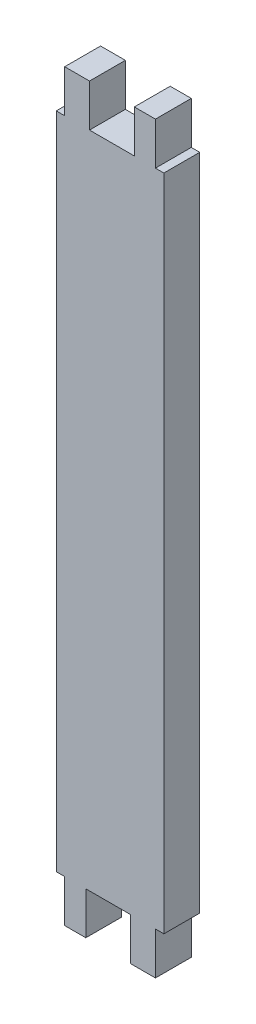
ISO-10303-21;
HEADER;
FILE_DESCRIPTION(('STEP AP214'),'2;1');
FILE_NAME('part.step','',(''),(''),'','','');
FILE_SCHEMA(('AUTOMOTIVE_DESIGN { 1 0 10303 214 1 1 1 1 }'));
ENDSEC;
DATA;
#1=APPLICATION_CONTEXT('core data for automotive mechanical design processes');
#2=APPLICATION_PROTOCOL_DEFINITION('international standard','automotive_design',2000,#1);
#3=PRODUCT_CONTEXT('',#1,'mechanical');
#4=PRODUCT('Part','Part','',(#3));
#5=PRODUCT_RELATED_PRODUCT_CATEGORY('part','',(#4));
#6=PRODUCT_DEFINITION_FORMATION('','',#4);
#7=PRODUCT_DEFINITION_CONTEXT('part definition',#1,'design');
#8=PRODUCT_DEFINITION('design','',#6,#7);
#9=PRODUCT_DEFINITION_SHAPE('','',#8);
#10=(LENGTH_UNIT() NAMED_UNIT(*) SI_UNIT(.MILLI.,.METRE.));
#11=(NAMED_UNIT(*) PLANE_ANGLE_UNIT() SI_UNIT($,.RADIAN.));
#12=(NAMED_UNIT(*) SI_UNIT($,.STERADIAN.) SOLID_ANGLE_UNIT());
#13=UNCERTAINTY_MEASURE_WITH_UNIT(LENGTH_MEASURE(1.E-05),#10,'distance_accuracy_value','');
#14=(GEOMETRIC_REPRESENTATION_CONTEXT(3) GLOBAL_UNCERTAINTY_ASSIGNED_CONTEXT((#13)) GLOBAL_UNIT_ASSIGNED_CONTEXT((#10,
#11,#12)) REPRESENTATION_CONTEXT('',''));
#15=CARTESIAN_POINT('',(0.,0.,0.));
#16=DIRECTION('',(0.,0.,1.));
#17=DIRECTION('',(1.,0.,0.));
#18=AXIS2_PLACEMENT_3D('',#15,#16,#17);
#19=CARTESIAN_POINT('',(-118.6,0.0500000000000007,184.2));
#20=DIRECTION('',(0.,-1.,0.));
#21=DIRECTION('',(0.,0.,-1.));
#22=AXIS2_PLACEMENT_3D('',#19,#20,#21);
#23=PLANE('',#22);
#24=DIRECTION('',(1.,0.,0.));
#25=VECTOR('',#24,1.);
#26=CARTESIAN_POINT('',(-118.6,0.0500000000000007,184.2));
#27=LINE('',#26,#25);
#28=CARTESIAN_POINT('',(-119.4,0.0500000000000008,184.2));
#29=VERTEX_POINT('',#28);
#30=CARTESIAN_POINT('',(-117.8,0.0500000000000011,184.2));
#31=VERTEX_POINT('',#30);
#32=EDGE_CURVE('E20',#29,#31,#27,.T.);
#33=ORIENTED_EDGE('',*,*,#32,.T.);
#34=DIRECTION('',(0.,0.,-1.));
#35=VECTOR('',#34,1.);
#36=CARTESIAN_POINT('',(-117.8,0.0500000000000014,184.2));
#37=LINE('',#36,#35);
#38=CARTESIAN_POINT('',(-117.8,0.0500000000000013,191.));
#39=VERTEX_POINT('',#38);
#40=EDGE_CURVE('E170',#39,#31,#37,.T.);
#41=ORIENTED_EDGE('',*,*,#40,.F.);
#42=DIRECTION('',(1.,0.,0.));
#43=VECTOR('',#42,1.);
#44=CARTESIAN_POINT('',(-128.,0.0500000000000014,191.));
#45=LINE('',#44,#43);
#46=CARTESIAN_POINT('',(-119.4,0.050000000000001,191.));
#47=VERTEX_POINT('',#46);
#48=EDGE_CURVE('E151',#47,#39,#45,.T.);
#49=ORIENTED_EDGE('',*,*,#48,.F.);
#50=DIRECTION('',(0.,0.,-1.));
#51=VECTOR('',#50,1.);
#52=CARTESIAN_POINT('',(-119.4,0.0500000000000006,184.2));
#53=LINE('',#52,#51);
#54=EDGE_CURVE('E174',#29,#47,#53,.F.);
#55=ORIENTED_EDGE('',*,*,#54,.F.);
#56=EDGE_LOOP('',(#33,#41,#49,#55));
#57=FACE_BOUND('',#56,.T.);
#58=ADVANCED_FACE('F17',(#57),#23,.T.);
#59=CARTESIAN_POINT('',(-118.6,124.95,184.2));
#60=DIRECTION('',(0.,1.,0.));
#61=DIRECTION('',(0.,0.,1.));
#62=AXIS2_PLACEMENT_3D('',#59,#60,#61);
#63=PLANE('',#62);
#64=DIRECTION('',(1.,0.,0.));
#65=VECTOR('',#64,1.);
#66=CARTESIAN_POINT('',(-118.6,124.95,184.2));
#67=LINE('',#66,#65);
#68=CARTESIAN_POINT('',(-117.8,124.95,184.2));
#69=VERTEX_POINT('',#68);
#70=CARTESIAN_POINT('',(-119.4,124.95,184.2));
#71=VERTEX_POINT('',#70);
#72=EDGE_CURVE('E190',#69,#71,#67,.F.);
#73=ORIENTED_EDGE('',*,*,#72,.T.);
#74=DIRECTION('',(0.,0.,-1.));
#75=VECTOR('',#74,1.);
#76=CARTESIAN_POINT('',(-119.4,124.95,184.2));
#77=LINE('',#76,#75);
#78=CARTESIAN_POINT('',(-119.4,124.95,191.));
#79=VERTEX_POINT('',#78);
#80=EDGE_CURVE('E195',#79,#71,#77,.T.);
#81=ORIENTED_EDGE('',*,*,#80,.F.);
#82=DIRECTION('',(1.,0.,0.));
#83=VECTOR('',#82,1.);
#84=CARTESIAN_POINT('',(-128.,124.95,191.));
#85=LINE('',#84,#83);
#86=CARTESIAN_POINT('',(-117.8,124.95,191.));
#87=VERTEX_POINT('',#86);
#88=EDGE_CURVE('E162',#87,#79,#85,.F.);
#89=ORIENTED_EDGE('',*,*,#88,.F.);
#90=DIRECTION('',(0.,0.,-1.));
#91=VECTOR('',#90,1.);
#92=CARTESIAN_POINT('',(-117.8,124.95,184.2));
#93=LINE('',#92,#91);
#94=EDGE_CURVE('E173',#69,#87,#93,.F.);
#95=ORIENTED_EDGE('',*,*,#94,.F.);
#96=EDGE_LOOP('',(#73,#81,#89,#95));
#97=FACE_BOUND('',#96,.T.);
#98=ADVANCED_FACE('F194',(#97),#63,.T.);
#99=CARTESIAN_POINT('',(-137.4,124.95,184.2));
#100=DIRECTION('',(0.,1.,0.));
#101=DIRECTION('',(0.,0.,1.));
#102=AXIS2_PLACEMENT_3D('',#99,#100,#101);
#103=PLANE('',#102);
#104=DIRECTION('',(1.,0.,0.));
#105=VECTOR('',#104,1.);
#106=CARTESIAN_POINT('',(-137.4,124.95,184.2));
#107=LINE('',#106,#105);
#108=CARTESIAN_POINT('',(-136.6,124.95,184.2));
#109=VERTEX_POINT('',#108);
#110=CARTESIAN_POINT('',(-138.2,124.95,184.2));
#111=VERTEX_POINT('',#110);
#112=EDGE_CURVE('E189',#109,#111,#107,.F.);
#113=ORIENTED_EDGE('',*,*,#112,.T.);
#114=DIRECTION('',(0.,0.,1.));
#115=VECTOR('',#114,1.);
#116=CARTESIAN_POINT('',(-138.2,124.95,184.2));
#117=LINE('',#116,#115);
#118=CARTESIAN_POINT('',(-138.2,124.95,191.));
#119=VERTEX_POINT('',#118);
#120=EDGE_CURVE('E254',#119,#111,#117,.F.);
#121=ORIENTED_EDGE('',*,*,#120,.F.);
#122=DIRECTION('',(1.,0.,0.));
#123=VECTOR('',#122,1.);
#124=CARTESIAN_POINT('',(-128.,124.95,191.));
#125=LINE('',#124,#123);
#126=CARTESIAN_POINT('',(-136.6,124.95,191.));
#127=VERTEX_POINT('',#126);
#128=EDGE_CURVE('E185',#127,#119,#125,.F.);
#129=ORIENTED_EDGE('',*,*,#128,.F.);
#130=DIRECTION('',(0.,0.,1.));
#131=VECTOR('',#130,1.);
#132=CARTESIAN_POINT('',(-136.6,124.95,184.2));
#133=LINE('',#132,#131);
#134=EDGE_CURVE('E260',#109,#127,#133,.T.);
#135=ORIENTED_EDGE('',*,*,#134,.F.);
#136=EDGE_LOOP('',(#113,#121,#129,#135));
#137=FACE_BOUND('',#136,.T.);
#138=ADVANCED_FACE('F362',(#137),#103,.T.);
#139=CARTESIAN_POINT('',(-137.4,0.0500000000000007,184.2));
#140=DIRECTION('',(0.,-1.,0.));
#141=DIRECTION('',(0.,0.,-1.));
#142=AXIS2_PLACEMENT_3D('',#139,#140,#141);
#143=PLANE('',#142);
#144=DIRECTION('',(1.,0.,0.));
#145=VECTOR('',#144,1.);
#146=CARTESIAN_POINT('',(-137.4,0.0500000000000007,184.2));
#147=LINE('',#146,#145);
#148=CARTESIAN_POINT('',(-138.2,0.0499999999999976,184.2));
#149=VERTEX_POINT('',#148);
#150=CARTESIAN_POINT('',(-136.6,0.0499999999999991,184.2));
#151=VERTEX_POINT('',#150);
#152=EDGE_CURVE('E163',#149,#151,#147,.T.);
#153=ORIENTED_EDGE('',*,*,#152,.T.);
#154=DIRECTION('',(0.,0.,1.));
#155=VECTOR('',#154,1.);
#156=CARTESIAN_POINT('',(-136.6,0.0500000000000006,184.2));
#157=LINE('',#156,#155);
#158=CARTESIAN_POINT('',(-136.6,0.0499999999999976,191.));
#159=VERTEX_POINT('',#158);
#160=EDGE_CURVE('E245',#159,#151,#157,.F.);
#161=ORIENTED_EDGE('',*,*,#160,.F.);
#162=DIRECTION('',(1.,0.,0.));
#163=VECTOR('',#162,1.);
#164=CARTESIAN_POINT('',(-128.,0.0499999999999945,191.));
#165=LINE('',#164,#163);
#166=CARTESIAN_POINT('',(-138.2,0.049999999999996,191.));
#167=VERTEX_POINT('',#166);
#168=EDGE_CURVE('E183',#167,#159,#165,.T.);
#169=ORIENTED_EDGE('',*,*,#168,.F.);
#170=DIRECTION('',(0.,0.,1.));
#171=VECTOR('',#170,1.);
#172=CARTESIAN_POINT('',(-138.2,0.0499999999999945,184.2));
#173=LINE('',#172,#171);
#174=EDGE_CURVE('E251',#149,#167,#173,.T.);
#175=ORIENTED_EDGE('',*,*,#174,.F.);
#176=EDGE_LOOP('',(#153,#161,#169,#175));
#177=FACE_BOUND('',#176,.T.);
#178=ADVANCED_FACE('F356',(#177),#143,.T.);
#179=CARTESIAN_POINT('',(-128.,62.5,191.));
#180=DIRECTION('',(0.,0.,1.));
#181=DIRECTION('',(1.,0.,0.));
#182=AXIS2_PLACEMENT_3D('',#179,#180,#181);
#183=PLANE('',#182);
#184=DIRECTION('',(0.,1.,0.));
#185=VECTOR('',#184,1.);
#186=CARTESIAN_POINT('',(-132.6,-3.975,191.));
#187=LINE('',#186,#185);
#188=CARTESIAN_POINT('',(-132.6,0.050000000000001,191.));
#189=VERTEX_POINT('',#188);
#190=CARTESIAN_POINT('',(-132.6,-8.,191.));
#191=VERTEX_POINT('',#190);
#192=EDGE_CURVE('E239',#189,#191,#187,.F.);
#193=ORIENTED_EDGE('',*,*,#192,.F.);
#194=DIRECTION('',(1.,0.,0.));
#195=VECTOR('',#194,1.);
#196=CARTESIAN_POINT('',(-128.35,0.0500000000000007,191.));
#197=LINE('',#196,#195);
#198=CARTESIAN_POINT('',(-124.1,0.050000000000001,191.));
#199=VERTEX_POINT('',#198);
#200=EDGE_CURVE('E235',#199,#189,#197,.F.);
#201=ORIENTED_EDGE('',*,*,#200,.F.);
#202=DIRECTION('',(0.,1.,0.));
#203=VECTOR('',#202,1.);
#204=CARTESIAN_POINT('',(-124.1,-3.975,191.));
#205=LINE('',#204,#203);
#206=CARTESIAN_POINT('',(-124.1,-8.,191.));
#207=VERTEX_POINT('',#206);
#208=EDGE_CURVE('E231',#207,#199,#205,.T.);
#209=ORIENTED_EDGE('',*,*,#208,.F.);
#210=DIRECTION('',(1.,0.,0.));
#211=VECTOR('',#210,1.);
#212=CARTESIAN_POINT('',(-121.75,-8.,191.));
#213=LINE('',#212,#211);
#214=CARTESIAN_POINT('',(-119.4,-8.,191.));
#215=VERTEX_POINT('',#214);
#216=EDGE_CURVE('E227',#215,#207,#213,.F.);
#217=ORIENTED_EDGE('',*,*,#216,.F.);
#218=DIRECTION('',(0.,1.,0.));
#219=VECTOR('',#218,1.);
#220=CARTESIAN_POINT('',(-119.4,-3.975,191.));
#221=LINE('',#220,#219);
#222=EDGE_CURVE('E157',#47,#215,#221,.F.);
#223=ORIENTED_EDGE('',*,*,#222,.F.);
#224=ORIENTED_EDGE('',*,*,#48,.T.);
#225=DIRECTION('',(0.,1.,0.));
#226=VECTOR('',#225,1.);
#227=CARTESIAN_POINT('',(-117.8,62.5,191.));
#228=LINE('',#227,#226);
#229=EDGE_CURVE('E155',#87,#39,#228,.F.);
#230=ORIENTED_EDGE('',*,*,#229,.F.);
#231=ORIENTED_EDGE('',*,*,#88,.T.);
#232=DIRECTION('',(0.,1.,0.));
#233=VECTOR('',#232,1.);
#234=CARTESIAN_POINT('',(-119.4,128.975,191.));
#235=LINE('',#234,#233);
#236=CARTESIAN_POINT('',(-119.4,133.,191.));
#237=VERTEX_POINT('',#236);
#238=EDGE_CURVE('E177',#237,#79,#235,.F.);
#239=ORIENTED_EDGE('',*,*,#238,.F.);
#240=DIRECTION('',(1.,0.,0.));
#241=VECTOR('',#240,1.);
#242=CARTESIAN_POINT('',(-121.4,133.,191.));
#243=LINE('',#242,#241);
#244=CARTESIAN_POINT('',(-123.4,133.,191.));
#245=VERTEX_POINT('',#244);
#246=EDGE_CURVE('E205',#245,#237,#243,.T.);
#247=ORIENTED_EDGE('',*,*,#246,.F.);
#248=DIRECTION('',(0.,1.,0.));
#249=VECTOR('',#248,1.);
#250=CARTESIAN_POINT('',(-123.4,128.975,191.));
#251=LINE('',#250,#249);
#252=CARTESIAN_POINT('',(-123.4,124.95,191.));
#253=VERTEX_POINT('',#252);
#254=EDGE_CURVE('E281',#253,#245,#251,.T.);
#255=ORIENTED_EDGE('',*,*,#254,.F.);
#256=DIRECTION('',(1.,0.,0.));
#257=VECTOR('',#256,1.);
#258=CARTESIAN_POINT('',(-127.65,124.95,191.));
#259=LINE('',#258,#257);
#260=CARTESIAN_POINT('',(-131.9,124.95,191.));
#261=VERTEX_POINT('',#260);
#262=EDGE_CURVE('E277',#261,#253,#259,.T.);
#263=ORIENTED_EDGE('',*,*,#262,.F.);
#264=DIRECTION('',(0.,1.,0.));
#265=VECTOR('',#264,1.);
#266=CARTESIAN_POINT('',(-131.9,128.975,191.));
#267=LINE('',#266,#265);
#268=CARTESIAN_POINT('',(-131.9,133.,191.));
#269=VERTEX_POINT('',#268);
#270=EDGE_CURVE('E273',#269,#261,#267,.F.);
#271=ORIENTED_EDGE('',*,*,#270,.F.);
#272=DIRECTION('',(1.,0.,0.));
#273=VECTOR('',#272,1.);
#274=CARTESIAN_POINT('',(-134.25,133.,191.));
#275=LINE('',#274,#273);
#276=CARTESIAN_POINT('',(-136.6,133.,191.));
#277=VERTEX_POINT('',#276);
#278=EDGE_CURVE('E269',#277,#269,#275,.T.);
#279=ORIENTED_EDGE('',*,*,#278,.F.);
#280=DIRECTION('',(0.,1.,0.));
#281=VECTOR('',#280,1.);
#282=CARTESIAN_POINT('',(-136.6,128.975,191.));
#283=LINE('',#282,#281);
#284=EDGE_CURVE('E265',#127,#277,#283,.T.);
#285=ORIENTED_EDGE('',*,*,#284,.F.);
#286=ORIENTED_EDGE('',*,*,#128,.T.);
#287=DIRECTION('',(0.,1.,0.));
#288=VECTOR('',#287,1.);
#289=CARTESIAN_POINT('',(-138.2,62.5,191.));
#290=LINE('',#289,#288);
#291=EDGE_CURVE('E257',#167,#119,#290,.T.);
#292=ORIENTED_EDGE('',*,*,#291,.F.);
#293=ORIENTED_EDGE('',*,*,#168,.T.);
#294=DIRECTION('',(0.,1.,0.));
#295=VECTOR('',#294,1.);
#296=CARTESIAN_POINT('',(-136.6,-3.975,191.));
#297=LINE('',#296,#295);
#298=CARTESIAN_POINT('',(-136.6,-8.,191.));
#299=VERTEX_POINT('',#298);
#300=EDGE_CURVE('E248',#299,#159,#297,.T.);
#301=ORIENTED_EDGE('',*,*,#300,.F.);
#302=DIRECTION('',(1.,0.,0.));
#303=VECTOR('',#302,1.);
#304=CARTESIAN_POINT('',(-134.6,-8.,191.));
#305=LINE('',#304,#303);
#306=EDGE_CURVE('E243',#191,#299,#305,.F.);
#307=ORIENTED_EDGE('',*,*,#306,.F.);
#308=EDGE_LOOP('',(#193,#201,#209,#217,#223,#224,#230,#231,#239,#247,#255,#263,#271,#279,#285,
#286,#292,#293,#301,#307));
#309=FACE_BOUND('',#308,.T.);
#310=ADVANCED_FACE('F154',(#309),#183,.T.);
#311=CARTESIAN_POINT('',(-119.4,-3.975,184.2));
#312=DIRECTION('',(1.,0.,0.));
#313=DIRECTION('',(0.,0.,-1.));
#314=AXIS2_PLACEMENT_3D('',#311,#312,#313);
#315=PLANE('',#314);
#316=DIRECTION('',(0.,1.,0.));
#317=VECTOR('',#316,1.);
#318=CARTESIAN_POINT('',(-119.4,62.5,184.2));
#319=LINE('',#318,#317);
#320=CARTESIAN_POINT('',(-119.4,-8.,184.2));
#321=VERTEX_POINT('',#320);
#322=EDGE_CURVE('E217',#321,#29,#319,.T.);
#323=ORIENTED_EDGE('',*,*,#322,.T.);
#324=ORIENTED_EDGE('',*,*,#54,.T.);
#325=ORIENTED_EDGE('',*,*,#222,.T.);
#326=DIRECTION('',(0.,0.,-1.));
#327=VECTOR('',#326,1.);
#328=CARTESIAN_POINT('',(-119.4,-8.,184.2));
#329=LINE('',#328,#327);
#330=EDGE_CURVE('E223',#321,#215,#329,.F.);
#331=ORIENTED_EDGE('',*,*,#330,.F.);
#332=EDGE_LOOP('',(#323,#324,#325,#331));
#333=FACE_BOUND('',#332,.T.);
#334=ADVANCED_FACE('F504',(#333),#315,.T.);
#335=CARTESIAN_POINT('',(-117.8,62.5,184.2));
#336=DIRECTION('',(1.,0.,0.));
#337=DIRECTION('',(0.,0.,-1.));
#338=AXIS2_PLACEMENT_3D('',#335,#336,#337);
#339=PLANE('',#338);
#340=DIRECTION('',(0.,1.,0.));
#341=VECTOR('',#340,1.);
#342=CARTESIAN_POINT('',(-117.8,62.5,184.2));
#343=LINE('',#342,#341);
#344=EDGE_CURVE('E213',#31,#69,#343,.T.);
#345=ORIENTED_EDGE('',*,*,#344,.T.);
#346=ORIENTED_EDGE('',*,*,#94,.T.);
#347=ORIENTED_EDGE('',*,*,#229,.T.);
#348=ORIENTED_EDGE('',*,*,#40,.T.);
#349=EDGE_LOOP('',(#345,#346,#347,#348));
#350=FACE_BOUND('',#349,.T.);
#351=ADVANCED_FACE('F169',(#350),#339,.T.);
#352=CARTESIAN_POINT('',(-119.4,128.975,184.2));
#353=DIRECTION('',(1.,0.,0.));
#354=DIRECTION('',(0.,0.,-1.));
#355=AXIS2_PLACEMENT_3D('',#352,#353,#354);
#356=PLANE('',#355);
#357=DIRECTION('',(0.,1.,0.));
#358=VECTOR('',#357,1.);
#359=CARTESIAN_POINT('',(-119.4,62.5,184.2));
#360=LINE('',#359,#358);
#361=CARTESIAN_POINT('',(-119.4,133.,184.2));
#362=VERTEX_POINT('',#361);
#363=EDGE_CURVE('E203',#71,#362,#360,.T.);
#364=ORIENTED_EDGE('',*,*,#363,.T.);
#365=DIRECTION('',(0.,0.,1.));
#366=VECTOR('',#365,1.);
#367=CARTESIAN_POINT('',(-119.4,133.,184.2));
#368=LINE('',#367,#366);
#369=EDGE_CURVE('E283',#237,#362,#368,.F.);
#370=ORIENTED_EDGE('',*,*,#369,.F.);
#371=ORIENTED_EDGE('',*,*,#238,.T.);
#372=ORIENTED_EDGE('',*,*,#80,.T.);
#373=EDGE_LOOP('',(#364,#370,#371,#372));
#374=FACE_BOUND('',#373,.T.);
#375=ADVANCED_FACE('F201',(#374),#356,.T.);
#376=CARTESIAN_POINT('',(-121.4,133.,184.2));
#377=DIRECTION('',(0.,1.,0.));
#378=DIRECTION('',(0.,0.,1.));
#379=AXIS2_PLACEMENT_3D('',#376,#377,#378);
#380=PLANE('',#379);
#381=DIRECTION('',(1.,0.,0.));
#382=VECTOR('',#381,1.);
#383=CARTESIAN_POINT('',(-128.,133.,184.2));
#384=LINE('',#383,#382);
#385=CARTESIAN_POINT('',(-123.4,133.,184.2));
#386=VERTEX_POINT('',#385);
#387=EDGE_CURVE('E212',#362,#386,#384,.F.);
#388=ORIENTED_EDGE('',*,*,#387,.T.);
#389=DIRECTION('',(0.,0.,1.));
#390=VECTOR('',#389,1.);
#391=CARTESIAN_POINT('',(-123.4,133.,184.2));
#392=LINE('',#391,#390);
#393=EDGE_CURVE('E279',#245,#386,#392,.F.);
#394=ORIENTED_EDGE('',*,*,#393,.F.);
#395=ORIENTED_EDGE('',*,*,#246,.T.);
#396=ORIENTED_EDGE('',*,*,#369,.T.);
#397=EDGE_LOOP('',(#388,#394,#395,#396));
#398=FACE_BOUND('',#397,.T.);
#399=ADVANCED_FACE('F288',(#398),#380,.T.);
#400=CARTESIAN_POINT('',(-123.4,128.975,184.2));
#401=DIRECTION('',(-1.,0.,0.));
#402=DIRECTION('',(0.,0.,1.));
#403=AXIS2_PLACEMENT_3D('',#400,#401,#402);
#404=PLANE('',#403);
#405=DIRECTION('',(0.,1.,0.));
#406=VECTOR('',#405,1.);
#407=CARTESIAN_POINT('',(-123.4,62.5,184.2));
#408=LINE('',#407,#406);
#409=CARTESIAN_POINT('',(-123.4,124.95,184.2));
#410=VERTEX_POINT('',#409);
#411=EDGE_CURVE('E215',#386,#410,#408,.F.);
#412=ORIENTED_EDGE('',*,*,#411,.T.);
#413=DIRECTION('',(0.,0.,1.));
#414=VECTOR('',#413,1.);
#415=CARTESIAN_POINT('',(-123.4,124.95,184.2));
#416=LINE('',#415,#414);
#417=EDGE_CURVE('E275',#253,#410,#416,.F.);
#418=ORIENTED_EDGE('',*,*,#417,.F.);
#419=ORIENTED_EDGE('',*,*,#254,.T.);
#420=ORIENTED_EDGE('',*,*,#393,.T.);
#421=EDGE_LOOP('',(#412,#418,#419,#420));
#422=FACE_BOUND('',#421,.T.);
#423=ADVANCED_FACE('F296',(#422),#404,.T.);
#424=CARTESIAN_POINT('',(-127.65,124.95,184.2));
#425=DIRECTION('',(0.,1.,0.));
#426=DIRECTION('',(0.,0.,1.));
#427=AXIS2_PLACEMENT_3D('',#424,#425,#426);
#428=PLANE('',#427);
#429=DIRECTION('',(1.,0.,0.));
#430=VECTOR('',#429,1.);
#431=CARTESIAN_POINT('',(-128.,124.95,184.2));
#432=LINE('',#431,#430);
#433=CARTESIAN_POINT('',(-131.9,124.95,184.2));
#434=VERTEX_POINT('',#433);
#435=EDGE_CURVE('E301',#410,#434,#432,.F.);
#436=ORIENTED_EDGE('',*,*,#435,.T.);
#437=DIRECTION('',(0.,0.,-1.));
#438=VECTOR('',#437,1.);
#439=CARTESIAN_POINT('',(-131.9,124.95,184.2));
#440=LINE('',#439,#438);
#441=EDGE_CURVE('E271',#261,#434,#440,.T.);
#442=ORIENTED_EDGE('',*,*,#441,.F.);
#443=ORIENTED_EDGE('',*,*,#262,.T.);
#444=ORIENTED_EDGE('',*,*,#417,.T.);
#445=EDGE_LOOP('',(#436,#442,#443,#444));
#446=FACE_BOUND('',#445,.T.);
#447=ADVANCED_FACE('F300',(#446),#428,.T.);
#448=CARTESIAN_POINT('',(-131.9,128.975,184.2));
#449=DIRECTION('',(1.,0.,0.));
#450=DIRECTION('',(0.,0.,-1.));
#451=AXIS2_PLACEMENT_3D('',#448,#449,#450);
#452=PLANE('',#451);
#453=DIRECTION('',(0.,1.,0.));
#454=VECTOR('',#453,1.);
#455=CARTESIAN_POINT('',(-131.9,62.5,184.2));
#456=LINE('',#455,#454);
#457=CARTESIAN_POINT('',(-131.9,133.,184.2));
#458=VERTEX_POINT('',#457);
#459=EDGE_CURVE('E305',#434,#458,#456,.T.);
#460=ORIENTED_EDGE('',*,*,#459,.T.);
#461=DIRECTION('',(0.,0.,1.));
#462=VECTOR('',#461,1.);
#463=CARTESIAN_POINT('',(-131.9,133.,184.2));
#464=LINE('',#463,#462);
#465=EDGE_CURVE('E267',#269,#458,#464,.F.);
#466=ORIENTED_EDGE('',*,*,#465,.F.);
#467=ORIENTED_EDGE('',*,*,#270,.T.);
#468=ORIENTED_EDGE('',*,*,#441,.T.);
#469=EDGE_LOOP('',(#460,#466,#467,#468));
#470=FACE_BOUND('',#469,.T.);
#471=ADVANCED_FACE('F372',(#470),#452,.T.);
#472=CARTESIAN_POINT('',(-134.25,133.,184.2));
#473=DIRECTION('',(0.,1.,0.));
#474=DIRECTION('',(0.,0.,1.));
#475=AXIS2_PLACEMENT_3D('',#472,#473,#474);
#476=PLANE('',#475);
#477=DIRECTION('',(1.,0.,0.));
#478=VECTOR('',#477,1.);
#479=CARTESIAN_POINT('',(-128.,133.,184.2));
#480=LINE('',#479,#478);
#481=CARTESIAN_POINT('',(-136.6,133.,184.2));
#482=VERTEX_POINT('',#481);
#483=EDGE_CURVE('E307',#458,#482,#480,.F.);
#484=ORIENTED_EDGE('',*,*,#483,.T.);
#485=DIRECTION('',(0.,0.,1.));
#486=VECTOR('',#485,1.);
#487=CARTESIAN_POINT('',(-136.6,133.,184.2));
#488=LINE('',#487,#486);
#489=EDGE_CURVE('E263',#277,#482,#488,.F.);
#490=ORIENTED_EDGE('',*,*,#489,.F.);
#491=ORIENTED_EDGE('',*,*,#278,.T.);
#492=ORIENTED_EDGE('',*,*,#465,.T.);
#493=EDGE_LOOP('',(#484,#490,#491,#492));
#494=FACE_BOUND('',#493,.T.);
#495=ADVANCED_FACE('F368',(#494),#476,.T.);
#496=CARTESIAN_POINT('',(-136.6,128.975,184.2));
#497=DIRECTION('',(-1.,0.,0.));
#498=DIRECTION('',(0.,0.,1.));
#499=AXIS2_PLACEMENT_3D('',#496,#497,#498);
#500=PLANE('',#499);
#501=DIRECTION('',(0.,1.,0.));
#502=VECTOR('',#501,1.);
#503=CARTESIAN_POINT('',(-136.6,62.5,184.2));
#504=LINE('',#503,#502);
#505=EDGE_CURVE('E312',#482,#109,#504,.F.);
#506=ORIENTED_EDGE('',*,*,#505,.T.);
#507=ORIENTED_EDGE('',*,*,#134,.T.);
#508=ORIENTED_EDGE('',*,*,#284,.T.);
#509=ORIENTED_EDGE('',*,*,#489,.T.);
#510=EDGE_LOOP('',(#506,#507,#508,#509));
#511=FACE_BOUND('',#510,.T.);
#512=ADVANCED_FACE('F374',(#511),#500,.T.);
#513=CARTESIAN_POINT('',(-138.2,62.5,184.2));
#514=DIRECTION('',(-1.,0.,0.));
#515=DIRECTION('',(0.,0.,1.));
#516=AXIS2_PLACEMENT_3D('',#513,#514,#515);
#517=PLANE('',#516);
#518=DIRECTION('',(0.,1.,0.));
#519=VECTOR('',#518,1.);
#520=CARTESIAN_POINT('',(-138.2,62.5,184.2));
#521=LINE('',#520,#519);
#522=EDGE_CURVE('E315',#111,#149,#521,.F.);
#523=ORIENTED_EDGE('',*,*,#522,.T.);
#524=ORIENTED_EDGE('',*,*,#174,.T.);
#525=ORIENTED_EDGE('',*,*,#291,.T.);
#526=ORIENTED_EDGE('',*,*,#120,.T.);
#527=EDGE_LOOP('',(#523,#524,#525,#526));
#528=FACE_BOUND('',#527,.T.);
#529=ADVANCED_FACE('F359',(#528),#517,.T.);
#530=CARTESIAN_POINT('',(-136.6,-3.975,184.2));
#531=DIRECTION('',(-1.,0.,0.));
#532=DIRECTION('',(0.,0.,1.));
#533=AXIS2_PLACEMENT_3D('',#530,#531,#532);
#534=PLANE('',#533);
#535=DIRECTION('',(0.,1.,0.));
#536=VECTOR('',#535,1.);
#537=CARTESIAN_POINT('',(-136.6,62.5,184.2));
#538=LINE('',#537,#536);
#539=CARTESIAN_POINT('',(-136.6,-8.,184.2));
#540=VERTEX_POINT('',#539);
#541=EDGE_CURVE('E318',#151,#540,#538,.F.);
#542=ORIENTED_EDGE('',*,*,#541,.T.);
#543=DIRECTION('',(0.,0.,-1.));
#544=VECTOR('',#543,1.);
#545=CARTESIAN_POINT('',(-136.6,-8.,184.2));
#546=LINE('',#545,#544);
#547=EDGE_CURVE('E241',#299,#540,#546,.T.);
#548=ORIENTED_EDGE('',*,*,#547,.F.);
#549=ORIENTED_EDGE('',*,*,#300,.T.);
#550=ORIENTED_EDGE('',*,*,#160,.T.);
#551=EDGE_LOOP('',(#542,#548,#549,#550));
#552=FACE_BOUND('',#551,.T.);
#553=ADVANCED_FACE('F351',(#552),#534,.T.);
#554=CARTESIAN_POINT('',(-134.6,-8.,184.2));
#555=DIRECTION('',(0.,-1.,0.));
#556=DIRECTION('',(0.,0.,-1.));
#557=AXIS2_PLACEMENT_3D('',#554,#555,#556);
#558=PLANE('',#557);
#559=DIRECTION('',(1.,0.,0.));
#560=VECTOR('',#559,1.);
#561=CARTESIAN_POINT('',(-128.,-8.00000000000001,184.2));
#562=LINE('',#561,#560);
#563=CARTESIAN_POINT('',(-132.6,-8.,184.2));
#564=VERTEX_POINT('',#563);
#565=EDGE_CURVE('E321',#540,#564,#562,.T.);
#566=ORIENTED_EDGE('',*,*,#565,.T.);
#567=DIRECTION('',(0.,0.,-1.));
#568=VECTOR('',#567,1.);
#569=CARTESIAN_POINT('',(-132.6,-8.,184.2));
#570=LINE('',#569,#568);
#571=EDGE_CURVE('E237',#191,#564,#570,.T.);
#572=ORIENTED_EDGE('',*,*,#571,.F.);
#573=ORIENTED_EDGE('',*,*,#306,.T.);
#574=ORIENTED_EDGE('',*,*,#547,.T.);
#575=EDGE_LOOP('',(#566,#572,#573,#574));
#576=FACE_BOUND('',#575,.T.);
#577=ADVANCED_FACE('F347',(#576),#558,.T.);
#578=CARTESIAN_POINT('',(-132.6,-3.975,184.2));
#579=DIRECTION('',(1.,0.,0.));
#580=DIRECTION('',(0.,0.,-1.));
#581=AXIS2_PLACEMENT_3D('',#578,#579,#580);
#582=PLANE('',#581);
#583=DIRECTION('',(0.,1.,0.));
#584=VECTOR('',#583,1.);
#585=CARTESIAN_POINT('',(-132.6,62.5,184.2));
#586=LINE('',#585,#584);
#587=CARTESIAN_POINT('',(-132.6,0.0500000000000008,184.2));
#588=VERTEX_POINT('',#587);
#589=EDGE_CURVE('E324',#564,#588,#586,.T.);
#590=ORIENTED_EDGE('',*,*,#589,.T.);
#591=DIRECTION('',(0.,0.,-1.));
#592=VECTOR('',#591,1.);
#593=CARTESIAN_POINT('',(-132.6,0.0500000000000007,184.2));
#594=LINE('',#593,#592);
#595=EDGE_CURVE('E233',#189,#588,#594,.T.);
#596=ORIENTED_EDGE('',*,*,#595,.F.);
#597=ORIENTED_EDGE('',*,*,#192,.T.);
#598=ORIENTED_EDGE('',*,*,#571,.T.);
#599=EDGE_LOOP('',(#590,#596,#597,#598));
#600=FACE_BOUND('',#599,.T.);
#601=ADVANCED_FACE('F341',(#600),#582,.T.);
#602=CARTESIAN_POINT('',(-128.35,0.0500000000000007,184.2));
#603=DIRECTION('',(0.,-1.,0.));
#604=DIRECTION('',(0.,0.,-1.));
#605=AXIS2_PLACEMENT_3D('',#602,#603,#604);
#606=PLANE('',#605);
#607=DIRECTION('',(1.,0.,0.));
#608=VECTOR('',#607,1.);
#609=CARTESIAN_POINT('',(-128.,0.0500000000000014,184.2));
#610=LINE('',#609,#608);
#611=CARTESIAN_POINT('',(-124.1,0.0500000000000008,184.2));
#612=VERTEX_POINT('',#611);
#613=EDGE_CURVE('E327',#588,#612,#610,.T.);
#614=ORIENTED_EDGE('',*,*,#613,.T.);
#615=DIRECTION('',(0.,0.,1.));
#616=VECTOR('',#615,1.);
#617=CARTESIAN_POINT('',(-124.1,0.0500000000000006,184.2));
#618=LINE('',#617,#616);
#619=EDGE_CURVE('E229',#199,#612,#618,.F.);
#620=ORIENTED_EDGE('',*,*,#619,.F.);
#621=ORIENTED_EDGE('',*,*,#200,.T.);
#622=ORIENTED_EDGE('',*,*,#595,.T.);
#623=EDGE_LOOP('',(#614,#620,#621,#622));
#624=FACE_BOUND('',#623,.T.);
#625=ADVANCED_FACE('F337',(#624),#606,.T.);
#626=CARTESIAN_POINT('',(-124.1,-3.975,184.2));
#627=DIRECTION('',(-1.,0.,0.));
#628=DIRECTION('',(0.,0.,1.));
#629=AXIS2_PLACEMENT_3D('',#626,#627,#628);
#630=PLANE('',#629);
#631=DIRECTION('',(0.,1.,0.));
#632=VECTOR('',#631,1.);
#633=CARTESIAN_POINT('',(-124.1,62.5,184.2));
#634=LINE('',#633,#632);
#635=CARTESIAN_POINT('',(-124.1,-8.,184.2));
#636=VERTEX_POINT('',#635);
#637=EDGE_CURVE('E26',#612,#636,#634,.F.);
#638=ORIENTED_EDGE('',*,*,#637,.T.);
#639=DIRECTION('',(0.,0.,-1.));
#640=VECTOR('',#639,1.);
#641=CARTESIAN_POINT('',(-124.1,-8.,184.2));
#642=LINE('',#641,#640);
#643=EDGE_CURVE('E34',#207,#636,#642,.T.);
#644=ORIENTED_EDGE('',*,*,#643,.F.);
#645=ORIENTED_EDGE('',*,*,#208,.T.);
#646=ORIENTED_EDGE('',*,*,#619,.T.);
#647=EDGE_LOOP('',(#638,#644,#645,#646));
#648=FACE_BOUND('',#647,.T.);
#649=ADVANCED_FACE('F332',(#648),#630,.T.);
#650=CARTESIAN_POINT('',(-121.75,-8.,184.2));
#651=DIRECTION('',(0.,-1.,0.));
#652=DIRECTION('',(0.,0.,-1.));
#653=AXIS2_PLACEMENT_3D('',#650,#651,#652);
#654=PLANE('',#653);
#655=DIRECTION('',(1.,0.,0.));
#656=VECTOR('',#655,1.);
#657=CARTESIAN_POINT('',(-128.,-8.00000000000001,184.2));
#658=LINE('',#657,#656);
#659=EDGE_CURVE('E11',#636,#321,#658,.T.);
#660=ORIENTED_EDGE('',*,*,#659,.T.);
#661=ORIENTED_EDGE('',*,*,#330,.T.);
#662=ORIENTED_EDGE('',*,*,#216,.T.);
#663=ORIENTED_EDGE('',*,*,#643,.T.);
#664=EDGE_LOOP('',(#660,#661,#662,#663));
#665=FACE_BOUND('',#664,.T.);
#666=ADVANCED_FACE('F385',(#665),#654,.T.);
#667=CARTESIAN_POINT('',(-128.,62.5,184.2));
#668=DIRECTION('',(0.,0.,1.));
#669=DIRECTION('',(1.,0.,0.));
#670=AXIS2_PLACEMENT_3D('',#667,#668,#669);
#671=PLANE('',#670);
#672=ORIENTED_EDGE('',*,*,#637,.F.);
#673=ORIENTED_EDGE('',*,*,#613,.F.);
#674=ORIENTED_EDGE('',*,*,#589,.F.);
#675=ORIENTED_EDGE('',*,*,#565,.F.);
#676=ORIENTED_EDGE('',*,*,#541,.F.);
#677=ORIENTED_EDGE('',*,*,#152,.F.);
#678=ORIENTED_EDGE('',*,*,#522,.F.);
#679=ORIENTED_EDGE('',*,*,#112,.F.);
#680=ORIENTED_EDGE('',*,*,#505,.F.);
#681=ORIENTED_EDGE('',*,*,#483,.F.);
#682=ORIENTED_EDGE('',*,*,#459,.F.);
#683=ORIENTED_EDGE('',*,*,#435,.F.);
#684=ORIENTED_EDGE('',*,*,#411,.F.);
#685=ORIENTED_EDGE('',*,*,#387,.F.);
#686=ORIENTED_EDGE('',*,*,#363,.F.);
#687=ORIENTED_EDGE('',*,*,#72,.F.);
#688=ORIENTED_EDGE('',*,*,#344,.F.);
#689=ORIENTED_EDGE('',*,*,#32,.F.);
#690=ORIENTED_EDGE('',*,*,#322,.F.);
#691=ORIENTED_EDGE('',*,*,#659,.F.);
#692=EDGE_LOOP('',(#672,#673,#674,#675,#676,#677,#678,#679,#680,#681,#682,#683,#684,#685,#686,
#687,#688,#689,#690,#691));
#693=FACE_BOUND('',#692,.T.);
#694=ADVANCED_FACE('F209',(#693),#671,.F.);
#695=CLOSED_SHELL('',(#58,#98,#138,#178,#310,#334,#351,#375,#399,#423,#447,#471,#495,#512,#529,
#553,#577,#601,#625,#649,#666,#694));
#696=MANIFOLD_SOLID_BREP('B1',#695);
#697=ADVANCED_BREP_SHAPE_REPRESENTATION('',(#18,#696),#14);
#698=SHAPE_DEFINITION_REPRESENTATION(#9,#697);
ENDSEC;
END-ISO-10303-21;
